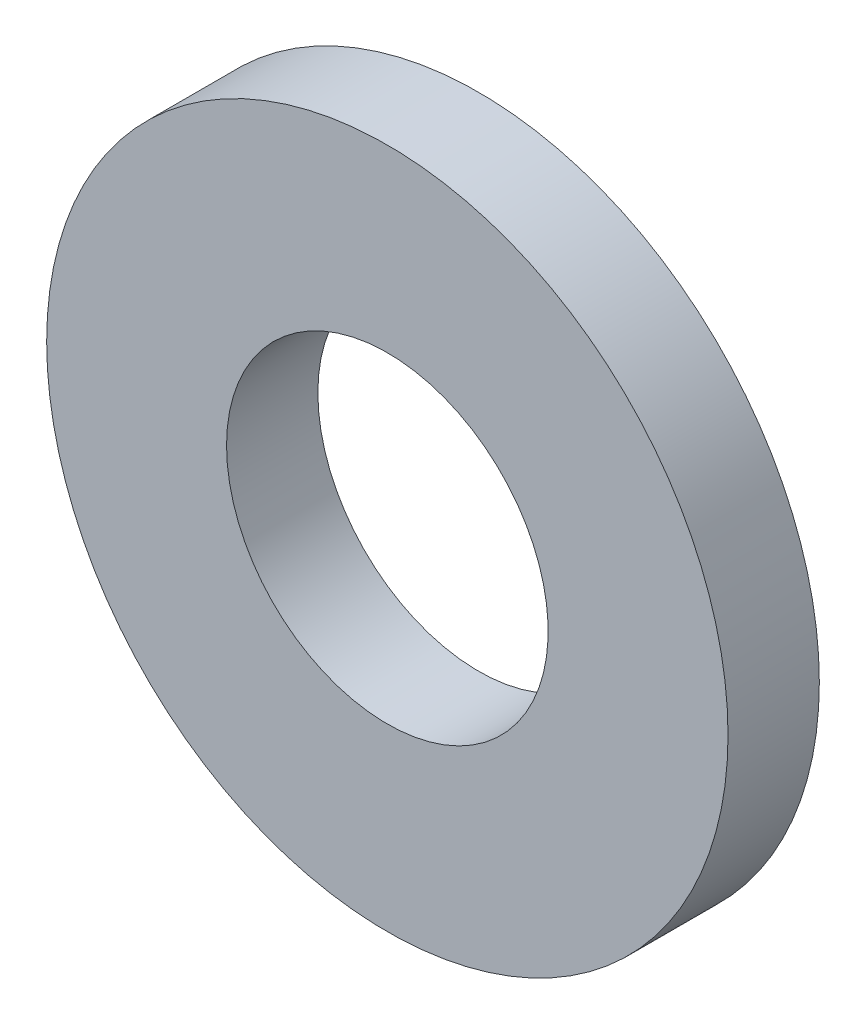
ISO-10303-21;
HEADER;
FILE_DESCRIPTION(('STEP AP214'),'2;1');
FILE_NAME('part.step','',(''),(''),'','','');
FILE_SCHEMA(('AUTOMOTIVE_DESIGN { 1 0 10303 214 1 1 1 1 }'));
ENDSEC;
DATA;
#1=APPLICATION_CONTEXT('core data for automotive mechanical design processes');
#2=APPLICATION_PROTOCOL_DEFINITION('international standard','automotive_design',2000,#1);
#3=PRODUCT_CONTEXT('',#1,'mechanical');
#4=PRODUCT('Part','Part','',(#3));
#5=PRODUCT_RELATED_PRODUCT_CATEGORY('part','',(#4));
#6=PRODUCT_DEFINITION_FORMATION('','',#4);
#7=PRODUCT_DEFINITION_CONTEXT('part definition',#1,'design');
#8=PRODUCT_DEFINITION('design','',#6,#7);
#9=PRODUCT_DEFINITION_SHAPE('','',#8);
#10=(LENGTH_UNIT() NAMED_UNIT(*) SI_UNIT(.MILLI.,.METRE.));
#11=(NAMED_UNIT(*) PLANE_ANGLE_UNIT() SI_UNIT($,.RADIAN.));
#12=(NAMED_UNIT(*) SI_UNIT($,.STERADIAN.) SOLID_ANGLE_UNIT());
#13=UNCERTAINTY_MEASURE_WITH_UNIT(LENGTH_MEASURE(1.E-05),#10,'distance_accuracy_value','');
#14=(GEOMETRIC_REPRESENTATION_CONTEXT(3) GLOBAL_UNCERTAINTY_ASSIGNED_CONTEXT((#13)) GLOBAL_UNIT_ASSIGNED_CONTEXT((#10,
#11,#12)) REPRESENTATION_CONTEXT('',''));
#15=CARTESIAN_POINT('',(0.,0.,0.));
#16=DIRECTION('',(0.,0.,1.));
#17=DIRECTION('',(1.,0.,0.));
#18=AXIS2_PLACEMENT_3D('',#15,#16,#17);
#19=CARTESIAN_POINT('',(0.,0.,-0.8509));
#20=DIRECTION('',(0.,0.,1.));
#21=DIRECTION('',(1.,0.,0.));
#22=AXIS2_PLACEMENT_3D('',#19,#20,#21);
#23=CYLINDRICAL_SURFACE('',#22,3.17500475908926);
#24=CARTESIAN_POINT('',(0.,0.,-0.8509));
#25=DIRECTION('',(0.,0.,-1.));
#26=DIRECTION('',(-1.,0.,0.));
#27=AXIS2_PLACEMENT_3D('',#24,#25,#26);
#28=CIRCLE('',#27,3.17500475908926);
#29=CARTESIAN_POINT('',(-3.17500475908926,0.,-0.8509));
#30=VERTEX_POINT('',#29);
#31=EDGE_CURVE('E10',#30,#30,#28,.T.);
#32=ORIENTED_EDGE('',*,*,#31,.F.);
#33=EDGE_LOOP('',(#32));
#34=FACE_BOUND('',#33,.T.);
#35=CARTESIAN_POINT('',(0.,0.,0.));
#36=DIRECTION('',(0.,0.,-1.));
#37=DIRECTION('',(-1.,0.,0.));
#38=AXIS2_PLACEMENT_3D('',#35,#36,#37);
#39=CIRCLE('',#38,3.17500475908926);
#40=CARTESIAN_POINT('',(-3.17500475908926,0.,0.));
#41=VERTEX_POINT('',#40);
#42=EDGE_CURVE('E37',#41,#41,#39,.T.);
#43=ORIENTED_EDGE('',*,*,#42,.T.);
#44=EDGE_LOOP('',(#43));
#45=FACE_BOUND('',#44,.T.);
#46=ADVANCED_FACE('F34',(#34,#45),#23,.T.);
#47=CARTESIAN_POINT('',(0.,0.,-0.8509));
#48=DIRECTION('',(0.,0.,-1.));
#49=DIRECTION('',(-1.,0.,0.));
#50=AXIS2_PLACEMENT_3D('',#47,#48,#49);
#51=PLANE('',#50);
#52=CARTESIAN_POINT('',(0.,0.,-0.8509));
#53=DIRECTION('',(0.,0.,-1.));
#54=DIRECTION('',(-1.,0.,0.));
#55=AXIS2_PLACEMENT_3D('',#52,#53,#54);
#56=CIRCLE('',#55,1.4986);
#57=CARTESIAN_POINT('',(-1.4986,0.,-0.8509));
#58=VERTEX_POINT('',#57);
#59=EDGE_CURVE('E48',#58,#58,#56,.T.);
#60=ORIENTED_EDGE('',*,*,#59,.F.);
#61=EDGE_LOOP('',(#60));
#62=FACE_BOUND('',#61,.T.);
#63=ORIENTED_EDGE('',*,*,#31,.T.);
#64=EDGE_LOOP('',(#63));
#65=FACE_BOUND('',#64,.T.);
#66=ADVANCED_FACE('F54',(#62,#65),#51,.T.);
#67=CARTESIAN_POINT('',(0.,0.,0.));
#68=DIRECTION('',(0.,0.,-1.));
#69=DIRECTION('',(-1.,0.,0.));
#70=AXIS2_PLACEMENT_3D('',#67,#68,#69);
#71=PLANE('',#70);
#72=CARTESIAN_POINT('',(0.,0.,0.));
#73=DIRECTION('',(0.,0.,-1.));
#74=DIRECTION('',(-1.,0.,0.));
#75=AXIS2_PLACEMENT_3D('',#72,#73,#74);
#76=CIRCLE('',#75,1.4986);
#77=CARTESIAN_POINT('',(-1.4986,0.,0.));
#78=VERTEX_POINT('',#77);
#79=EDGE_CURVE('E44',#78,#78,#76,.T.);
#80=ORIENTED_EDGE('',*,*,#79,.T.);
#81=EDGE_LOOP('',(#80));
#82=FACE_BOUND('',#81,.T.);
#83=ORIENTED_EDGE('',*,*,#42,.F.);
#84=EDGE_LOOP('',(#83));
#85=FACE_BOUND('',#84,.T.);
#86=ADVANCED_FACE('F56',(#82,#85),#71,.F.);
#87=CARTESIAN_POINT('',(0.,0.,-0.8509));
#88=DIRECTION('',(0.,0.,-1.));
#89=DIRECTION('',(-1.,0.,0.));
#90=AXIS2_PLACEMENT_3D('',#87,#88,#89);
#91=CYLINDRICAL_SURFACE('',#90,1.4986);
#92=ORIENTED_EDGE('',*,*,#79,.F.);
#93=EDGE_LOOP('',(#92));
#94=FACE_BOUND('',#93,.T.);
#95=ORIENTED_EDGE('',*,*,#59,.T.);
#96=EDGE_LOOP('',(#95));
#97=FACE_BOUND('',#96,.T.);
#98=ADVANCED_FACE('F52',(#94,#97),#91,.F.);
#99=CLOSED_SHELL('',(#46,#66,#86,#98));
#100=MANIFOLD_SOLID_BREP('B2',#99);
#101=ADVANCED_BREP_SHAPE_REPRESENTATION('',(#18,#100),#14);
#102=SHAPE_DEFINITION_REPRESENTATION(#9,#101);
ENDSEC;
END-ISO-10303-21;
